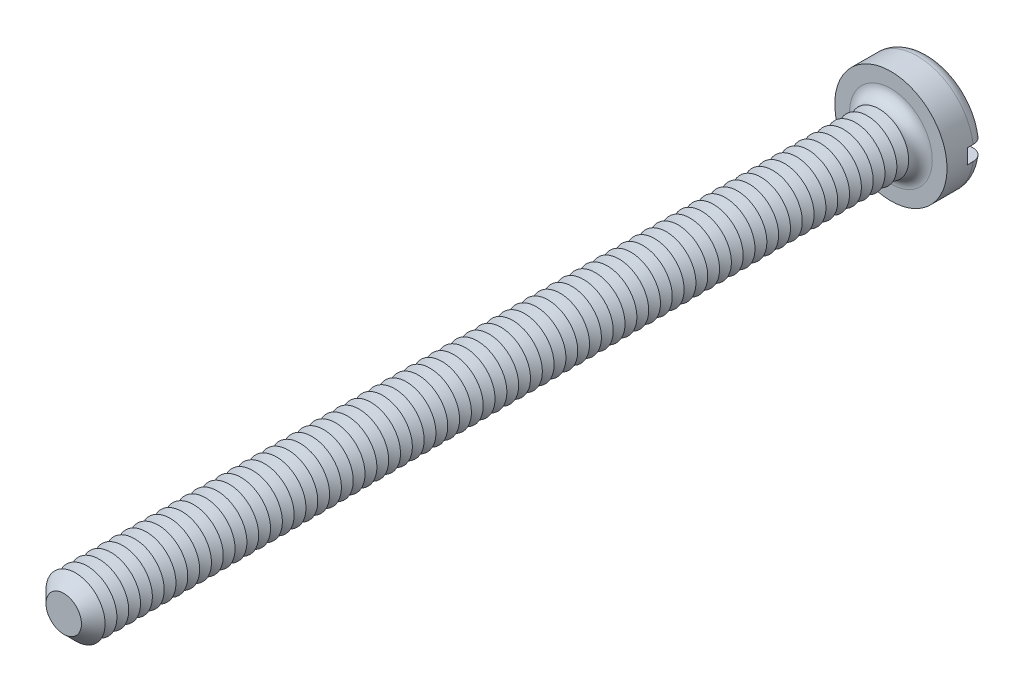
from build123d import *

# Parameters (mm, degrees)
SKETCH3_R           = 1.9
BOSS_EXTRUDE2_DEPTH = 1.3
SKETCH4_R           = 1
BOSS_EXTRUDE3_DEPTH = 28
FILLET1_R           = 0.4
CHAMFER1_SIZE       = 0.4
LPATTERN1_COUNT     = 68
LPATTERN1_PITCH     = 0.4
SKETCH8_W           = 3.8
SKETCH8_H           = 0.5
CUT_EXTRUDE1_DEPTH  = 0.6


with BuildPart() as part:
    # Sketch3 → Boss-Extrude2 (new body)
    with BuildSketch(Plane.XY):
        Circle(SKETCH3_R)
    extrude(amount=-BOSS_EXTRUDE2_DEPTH)

    # Sketch4 → Boss-Extrude3 (add)
    with BuildSketch(Plane.XY):
        Circle(SKETCH4_R)
    extrude(amount=BOSS_EXTRUDE3_DEPTH)

    # Fillet1
    fillet1_edges = [part.edges().sort_by_distance(p)[0] for p in [
        (-1.9, 0, -1.3),
        (-1, 0, 0),
    ]]
    fillet(fillet1_edges, radius=FILLET1_R)

    # Chamfer1
    chamfer1_edges = [part.edges().sort_by_distance(p)[0] for p in [
        (-1, 0, 28),
    ]]
    chamfer(chamfer1_edges, length=CHAMFER1_SIZE)

    # Sketch6 → Cut-Revolve1 (revolve, cut)
    with BuildSketch(Plane(origin=(0, 0, 0), x_dir=(0, 0, -1), z_dir=(1, 0, 0)), mode=Mode.PRIVATE) as cut_revolve1_sk:
        Polygon((-0.4, 1), (-0.6, 0.653589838), (-0.8, 1), align=None)
    cut_revolve1 = revolve(cut_revolve1_sk.sketch.rotate(Axis((0, 0, -1.694361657), (0, 0, 1)), 90), axis=Axis((0, 0, -1.694361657), (0, 0, 1)), mode=Mode.SUBTRACT)

    # LPattern1: Cut-Revolve1 ×68
    with Locations(*[(0, 0, i * LPATTERN1_PITCH) for i in range(1, LPATTERN1_COUNT)]):
        add(cut_revolve1, mode=Mode.SUBTRACT)

    # Sketch8 → Cut-Extrude1 (cut)
    with BuildSketch(Plane(origin=(0, 0, -1.3), x_dir=(-1, 0, 0), z_dir=(0, 0, -1))):
        Rectangle(SKETCH8_W, SKETCH8_H)
    extrude(amount=-CUT_EXTRUDE1_DEPTH, mode=Mode.SUBTRACT)


solid = part.part
